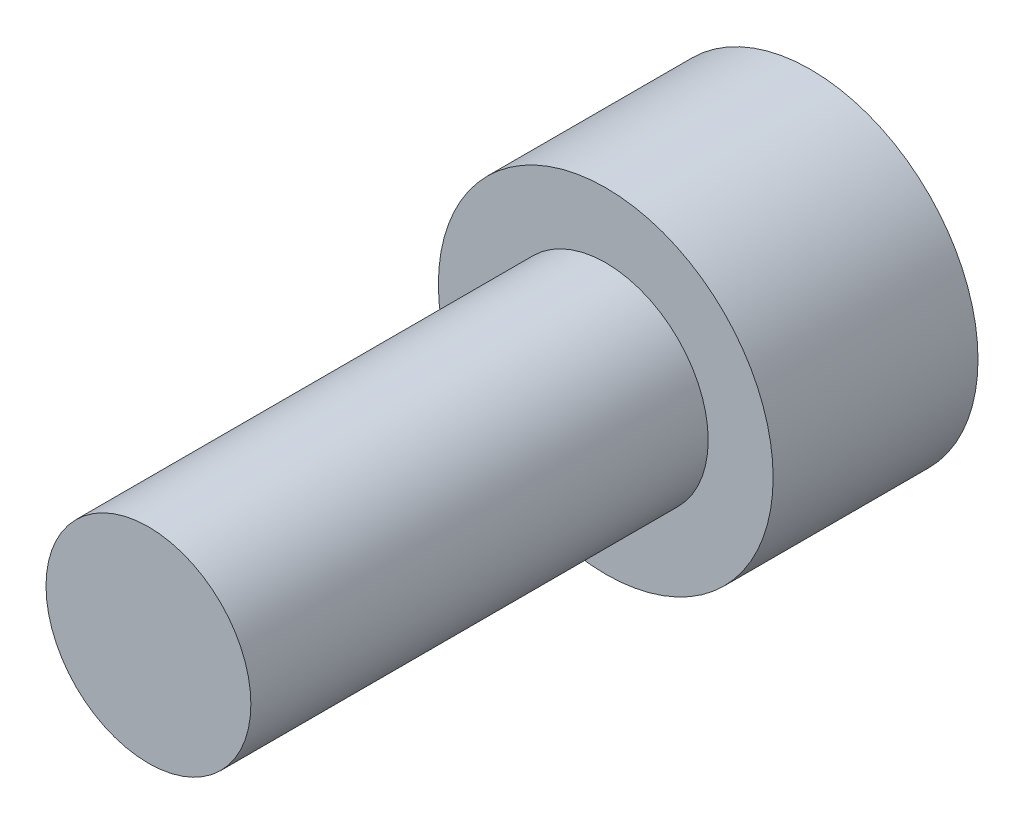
ISO-10303-21;
HEADER;
FILE_DESCRIPTION(('STEP AP214'),'2;1');
FILE_NAME('part.step','',(''),(''),'','','');
FILE_SCHEMA(('AUTOMOTIVE_DESIGN { 1 0 10303 214 1 1 1 1 }'));
ENDSEC;
DATA;
#1=APPLICATION_CONTEXT('core data for automotive mechanical design processes');
#2=APPLICATION_PROTOCOL_DEFINITION('international standard','automotive_design',2000,#1);
#3=PRODUCT_CONTEXT('',#1,'mechanical');
#4=PRODUCT('Part','Part','',(#3));
#5=PRODUCT_RELATED_PRODUCT_CATEGORY('part','',(#4));
#6=PRODUCT_DEFINITION_FORMATION('','',#4);
#7=PRODUCT_DEFINITION_CONTEXT('part definition',#1,'design');
#8=PRODUCT_DEFINITION('design','',#6,#7);
#9=PRODUCT_DEFINITION_SHAPE('','',#8);
#10=(LENGTH_UNIT() NAMED_UNIT(*) SI_UNIT(.MILLI.,.METRE.));
#11=(NAMED_UNIT(*) PLANE_ANGLE_UNIT() SI_UNIT($,.RADIAN.));
#12=(NAMED_UNIT(*) SI_UNIT($,.STERADIAN.) SOLID_ANGLE_UNIT());
#13=UNCERTAINTY_MEASURE_WITH_UNIT(LENGTH_MEASURE(1.E-05),#10,'distance_accuracy_value','');
#14=(GEOMETRIC_REPRESENTATION_CONTEXT(3) GLOBAL_UNCERTAINTY_ASSIGNED_CONTEXT((#13)) GLOBAL_UNIT_ASSIGNED_CONTEXT((#10,
#11,#12)) REPRESENTATION_CONTEXT('',''));
#15=CARTESIAN_POINT('',(0.,0.,0.));
#16=DIRECTION('',(0.,0.,1.));
#17=DIRECTION('',(1.,0.,0.));
#18=AXIS2_PLACEMENT_3D('',#15,#16,#17);
#19=CARTESIAN_POINT('',(0.,-2.3241,-2.8448));
#20=DIRECTION('',(0.,0.,-1.));
#21=DIRECTION('',(-1.,0.,0.));
#22=AXIS2_PLACEMENT_3D('',#19,#20,#21);
#23=PLANE('',#22);
#24=DIRECTION('',(0.866025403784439,-0.5,0.));
#25=VECTOR('',#24,1.);
#26=CARTESIAN_POINT('',(0.,1.36381680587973,-2.8448));
#27=LINE('',#26,#25);
#28=CARTESIAN_POINT('',(0.,1.36381680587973,-2.8448));
#29=VERTEX_POINT('',#28);
#30=CARTESIAN_POINT('',(1.1811,0.681908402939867,-2.8448));
#31=VERTEX_POINT('',#30);
#32=EDGE_CURVE('E51',#29,#31,#27,.T.);
#33=ORIENTED_EDGE('',*,*,#32,.F.);
#34=DIRECTION('',(0.866025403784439,0.5,0.));
#35=VECTOR('',#34,1.);
#36=CARTESIAN_POINT('',(-1.1811,0.681908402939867,-2.8448));
#37=LINE('',#36,#35);
#38=CARTESIAN_POINT('',(-1.1811,0.681908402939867,-2.8448));
#39=VERTEX_POINT('',#38);
#40=EDGE_CURVE('E134',#39,#29,#37,.T.);
#41=ORIENTED_EDGE('',*,*,#40,.F.);
#42=DIRECTION('',(0.,1.,0.));
#43=VECTOR('',#42,1.);
#44=CARTESIAN_POINT('',(-1.1811,-0.681908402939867,-2.8448));
#45=LINE('',#44,#43);
#46=CARTESIAN_POINT('',(-1.1811,-0.681908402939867,-2.8448));
#47=VERTEX_POINT('',#46);
#48=EDGE_CURVE('E132',#47,#39,#45,.T.);
#49=ORIENTED_EDGE('',*,*,#48,.F.);
#50=DIRECTION('',(-0.866025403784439,0.5,0.));
#51=VECTOR('',#50,1.);
#52=CARTESIAN_POINT('',(0.,-1.36381680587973,-2.8448));
#53=LINE('',#52,#51);
#54=CARTESIAN_POINT('',(0.,-1.36381680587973,-2.8448));
#55=VERTEX_POINT('',#54);
#56=EDGE_CURVE('E99',#55,#47,#53,.T.);
#57=ORIENTED_EDGE('',*,*,#56,.F.);
#58=DIRECTION('',(-0.866025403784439,-0.5,0.));
#59=VECTOR('',#58,1.);
#60=CARTESIAN_POINT('',(1.1811,-0.681908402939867,-2.8448));
#61=LINE('',#60,#59);
#62=CARTESIAN_POINT('',(1.1811,-0.681908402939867,-2.8448));
#63=VERTEX_POINT('',#62);
#64=EDGE_CURVE('E128',#63,#55,#61,.T.);
#65=ORIENTED_EDGE('',*,*,#64,.F.);
#66=DIRECTION('',(0.,-1.,0.));
#67=VECTOR('',#66,1.);
#68=CARTESIAN_POINT('',(1.1811,0.681908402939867,-2.8448));
#69=LINE('',#68,#67);
#70=EDGE_CURVE('E125',#31,#63,#69,.T.);
#71=ORIENTED_EDGE('',*,*,#70,.F.);
#72=EDGE_LOOP('',(#33,#41,#49,#57,#65,#71));
#73=FACE_BOUND('',#72,.T.);
#74=CARTESIAN_POINT('',(0.,0.,-2.8448));
#75=DIRECTION('',(0.,0.,1.));
#76=DIRECTION('',(1.,0.,0.));
#77=AXIS2_PLACEMENT_3D('',#74,#75,#76);
#78=CIRCLE('',#77,2.3241);
#79=CARTESIAN_POINT('',(2.3241,0.,-2.8448));
#80=VERTEX_POINT('',#79);
#81=EDGE_CURVE('E11',#80,#80,#78,.T.);
#82=ORIENTED_EDGE('',*,*,#81,.F.);
#83=EDGE_LOOP('',(#82));
#84=FACE_BOUND('',#83,.T.);
#85=ADVANCED_FACE('F37',(#73,#84),#23,.T.);
#86=CARTESIAN_POINT('',(0.,0.,6.35));
#87=DIRECTION('',(0.,0.,1.));
#88=DIRECTION('',(1.,0.,0.));
#89=AXIS2_PLACEMENT_3D('',#86,#87,#88);
#90=CYLINDRICAL_SURFACE('',#89,2.3241);
#91=ORIENTED_EDGE('',*,*,#81,.T.);
#92=EDGE_LOOP('',(#91));
#93=FACE_BOUND('',#92,.T.);
#94=CARTESIAN_POINT('',(0.,0.,0.));
#95=DIRECTION('',(0.,0.,1.));
#96=DIRECTION('',(1.,0.,0.));
#97=AXIS2_PLACEMENT_3D('',#94,#95,#96);
#98=CIRCLE('',#97,2.3241);
#99=CARTESIAN_POINT('',(2.3241,0.,0.));
#100=VERTEX_POINT('',#99);
#101=EDGE_CURVE('E44',#100,#100,#98,.T.);
#102=ORIENTED_EDGE('',*,*,#101,.F.);
#103=EDGE_LOOP('',(#102));
#104=FACE_BOUND('',#103,.T.);
#105=ADVANCED_FACE('F154',(#93,#104),#90,.T.);
#106=CARTESIAN_POINT('',(0.,-1.4224,0.));
#107=DIRECTION('',(0.,0.,1.));
#108=DIRECTION('',(1.,0.,0.));
#109=AXIS2_PLACEMENT_3D('',#106,#107,#108);
#110=PLANE('',#109);
#111=ORIENTED_EDGE('',*,*,#101,.T.);
#112=EDGE_LOOP('',(#111));
#113=FACE_BOUND('',#112,.T.);
#114=CARTESIAN_POINT('',(0.,0.,0.));
#115=DIRECTION('',(0.,0.,1.));
#116=DIRECTION('',(1.,0.,0.));
#117=AXIS2_PLACEMENT_3D('',#114,#115,#116);
#118=CIRCLE('',#117,1.4224);
#119=CARTESIAN_POINT('',(1.4224,0.,0.));
#120=VERTEX_POINT('',#119);
#121=EDGE_CURVE('E146',#120,#120,#118,.T.);
#122=ORIENTED_EDGE('',*,*,#121,.F.);
#123=EDGE_LOOP('',(#122));
#124=FACE_BOUND('',#123,.T.);
#125=ADVANCED_FACE('F151',(#113,#124),#110,.T.);
#126=CARTESIAN_POINT('',(0.,0.,6.35));
#127=DIRECTION('',(0.,0.,1.));
#128=DIRECTION('',(1.,0.,0.));
#129=AXIS2_PLACEMENT_3D('',#126,#127,#128);
#130=CYLINDRICAL_SURFACE('',#129,1.4224);
#131=ORIENTED_EDGE('',*,*,#121,.T.);
#132=EDGE_LOOP('',(#131));
#133=FACE_BOUND('',#132,.T.);
#134=CARTESIAN_POINT('',(0.,0.,6.35));
#135=DIRECTION('',(0.,0.,1.));
#136=DIRECTION('',(1.,0.,0.));
#137=AXIS2_PLACEMENT_3D('',#134,#135,#136);
#138=CIRCLE('',#137,1.4224);
#139=CARTESIAN_POINT('',(1.4224,0.,6.35));
#140=VERTEX_POINT('',#139);
#141=EDGE_CURVE('E138',#140,#140,#138,.T.);
#142=ORIENTED_EDGE('',*,*,#141,.F.);
#143=EDGE_LOOP('',(#142));
#144=FACE_BOUND('',#143,.T.);
#145=ADVANCED_FACE('F161',(#133,#144),#130,.T.);
#146=CARTESIAN_POINT('',(0.,0.,6.35));
#147=DIRECTION('',(0.,0.,1.));
#148=DIRECTION('',(1.,0.,0.));
#149=AXIS2_PLACEMENT_3D('',#146,#147,#148);
#150=PLANE('',#149);
#151=ORIENTED_EDGE('',*,*,#141,.T.);
#152=EDGE_LOOP('',(#151));
#153=FACE_BOUND('',#152,.T.);
#154=ADVANCED_FACE('F167',(#153),#150,.T.);
#155=CARTESIAN_POINT('',(0.,1.36381680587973,-1.0668));
#156=DIRECTION('',(0.5,0.866025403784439,0.));
#157=DIRECTION('',(-0.866025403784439,0.5,0.));
#158=AXIS2_PLACEMENT_3D('',#155,#156,#157);
#159=PLANE('',#158);
#160=ORIENTED_EDGE('',*,*,#32,.T.);
#161=DIRECTION('',(0.,0.,-1.));
#162=VECTOR('',#161,1.);
#163=CARTESIAN_POINT('',(1.1811,0.681908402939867,-1.0668));
#164=LINE('',#163,#162);
#165=CARTESIAN_POINT('',(1.1811,0.681908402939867,-1.0668));
#166=VERTEX_POINT('',#165);
#167=EDGE_CURVE('E81',#166,#31,#164,.T.);
#168=ORIENTED_EDGE('',*,*,#167,.F.);
#169=DIRECTION('',(0.866025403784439,-0.5,0.));
#170=VECTOR('',#169,1.);
#171=CARTESIAN_POINT('',(0.,1.36381680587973,-1.0668));
#172=LINE('',#171,#170);
#173=CARTESIAN_POINT('',(0.,1.36381680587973,-1.0668));
#174=VERTEX_POINT('',#173);
#175=EDGE_CURVE('E136',#174,#166,#172,.T.);
#176=ORIENTED_EDGE('',*,*,#175,.F.);
#177=DIRECTION('',(0.,0.,-1.));
#178=VECTOR('',#177,1.);
#179=CARTESIAN_POINT('',(0.,1.36381680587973,-1.0668));
#180=LINE('',#179,#178);
#181=EDGE_CURVE('E59',#174,#29,#180,.T.);
#182=ORIENTED_EDGE('',*,*,#181,.T.);
#183=EDGE_LOOP('',(#160,#168,#176,#182));
#184=FACE_BOUND('',#183,.T.);
#185=ADVANCED_FACE('F171',(#184),#159,.F.);
#186=CARTESIAN_POINT('',(-1.1811,0.681908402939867,-1.0668));
#187=DIRECTION('',(-0.5,0.866025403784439,0.));
#188=DIRECTION('',(-0.866025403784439,-0.5,0.));
#189=AXIS2_PLACEMENT_3D('',#186,#187,#188);
#190=PLANE('',#189);
#191=ORIENTED_EDGE('',*,*,#40,.T.);
#192=ORIENTED_EDGE('',*,*,#181,.F.);
#193=DIRECTION('',(0.866025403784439,0.5,0.));
#194=VECTOR('',#193,1.);
#195=CARTESIAN_POINT('',(-1.1811,0.681908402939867,-1.0668));
#196=LINE('',#195,#194);
#197=CARTESIAN_POINT('',(-1.1811,0.681908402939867,-1.0668));
#198=VERTEX_POINT('',#197);
#199=EDGE_CURVE('E111',#198,#174,#196,.T.);
#200=ORIENTED_EDGE('',*,*,#199,.F.);
#201=DIRECTION('',(0.,0.,-1.));
#202=VECTOR('',#201,1.);
#203=CARTESIAN_POINT('',(-1.1811,0.681908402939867,-1.0668));
#204=LINE('',#203,#202);
#205=EDGE_CURVE('E103',#198,#39,#204,.T.);
#206=ORIENTED_EDGE('',*,*,#205,.T.);
#207=EDGE_LOOP('',(#191,#192,#200,#206));
#208=FACE_BOUND('',#207,.T.);
#209=ADVANCED_FACE('F175',(#208),#190,.F.);
#210=CARTESIAN_POINT('',(-1.1811,-0.681908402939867,-1.0668));
#211=DIRECTION('',(-1.,0.,0.));
#212=DIRECTION('',(0.,-1.,0.));
#213=AXIS2_PLACEMENT_3D('',#210,#211,#212);
#214=PLANE('',#213);
#215=ORIENTED_EDGE('',*,*,#48,.T.);
#216=ORIENTED_EDGE('',*,*,#205,.F.);
#217=DIRECTION('',(0.,1.,0.));
#218=VECTOR('',#217,1.);
#219=CARTESIAN_POINT('',(-1.1811,-0.681908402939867,-1.0668));
#220=LINE('',#219,#218);
#221=CARTESIAN_POINT('',(-1.1811,-0.681908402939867,-1.0668));
#222=VERTEX_POINT('',#221);
#223=EDGE_CURVE('E107',#222,#198,#220,.T.);
#224=ORIENTED_EDGE('',*,*,#223,.F.);
#225=DIRECTION('',(0.,0.,-1.));
#226=VECTOR('',#225,1.);
#227=CARTESIAN_POINT('',(-1.1811,-0.681908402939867,-1.0668));
#228=LINE('',#227,#226);
#229=EDGE_CURVE('E92',#222,#47,#228,.T.);
#230=ORIENTED_EDGE('',*,*,#229,.T.);
#231=EDGE_LOOP('',(#215,#216,#224,#230));
#232=FACE_BOUND('',#231,.T.);
#233=ADVANCED_FACE('F108',(#232),#214,.F.);
#234=CARTESIAN_POINT('',(0.,-1.36381680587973,-1.0668));
#235=DIRECTION('',(-0.5,-0.866025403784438,0.));
#236=DIRECTION('',(0.866025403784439,-0.5,0.));
#237=AXIS2_PLACEMENT_3D('',#234,#235,#236);
#238=PLANE('',#237);
#239=ORIENTED_EDGE('',*,*,#56,.T.);
#240=ORIENTED_EDGE('',*,*,#229,.F.);
#241=DIRECTION('',(-0.866025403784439,0.5,0.));
#242=VECTOR('',#241,1.);
#243=CARTESIAN_POINT('',(0.,-1.36381680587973,-1.0668));
#244=LINE('',#243,#242);
#245=CARTESIAN_POINT('',(0.,-1.36381680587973,-1.0668));
#246=VERTEX_POINT('',#245);
#247=EDGE_CURVE('E96',#246,#222,#244,.T.);
#248=ORIENTED_EDGE('',*,*,#247,.F.);
#249=DIRECTION('',(0.,0.,-1.));
#250=VECTOR('',#249,1.);
#251=CARTESIAN_POINT('',(0.,-1.36381680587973,-1.0668));
#252=LINE('',#251,#250);
#253=EDGE_CURVE('E104',#246,#55,#252,.T.);
#254=ORIENTED_EDGE('',*,*,#253,.T.);
#255=EDGE_LOOP('',(#239,#240,#248,#254));
#256=FACE_BOUND('',#255,.T.);
#257=ADVANCED_FACE('F94',(#256),#238,.F.);
#258=CARTESIAN_POINT('',(1.1811,-0.681908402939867,-1.0668));
#259=DIRECTION('',(0.5,-0.866025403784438,0.));
#260=DIRECTION('',(0.866025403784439,0.5,0.));
#261=AXIS2_PLACEMENT_3D('',#258,#259,#260);
#262=PLANE('',#261);
#263=ORIENTED_EDGE('',*,*,#64,.T.);
#264=ORIENTED_EDGE('',*,*,#253,.F.);
#265=DIRECTION('',(-0.866025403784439,-0.5,0.));
#266=VECTOR('',#265,1.);
#267=CARTESIAN_POINT('',(1.1811,-0.681908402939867,-1.0668));
#268=LINE('',#267,#266);
#269=CARTESIAN_POINT('',(1.1811,-0.681908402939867,-1.0668));
#270=VERTEX_POINT('',#269);
#271=EDGE_CURVE('E117',#270,#246,#268,.T.);
#272=ORIENTED_EDGE('',*,*,#271,.F.);
#273=DIRECTION('',(0.,0.,-1.));
#274=VECTOR('',#273,1.);
#275=CARTESIAN_POINT('',(1.1811,-0.681908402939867,-1.0668));
#276=LINE('',#275,#274);
#277=EDGE_CURVE('E141',#270,#63,#276,.T.);
#278=ORIENTED_EDGE('',*,*,#277,.T.);
#279=EDGE_LOOP('',(#263,#264,#272,#278));
#280=FACE_BOUND('',#279,.T.);
#281=ADVANCED_FACE('F179',(#280),#262,.F.);
#282=CARTESIAN_POINT('',(1.1811,0.681908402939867,-1.0668));
#283=DIRECTION('',(1.,0.,0.));
#284=DIRECTION('',(0.,0.,-1.));
#285=AXIS2_PLACEMENT_3D('',#282,#283,#284);
#286=PLANE('',#285);
#287=ORIENTED_EDGE('',*,*,#70,.T.);
#288=ORIENTED_EDGE('',*,*,#277,.F.);
#289=DIRECTION('',(0.,-1.,0.));
#290=VECTOR('',#289,1.);
#291=CARTESIAN_POINT('',(1.1811,0.681908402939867,-1.0668));
#292=LINE('',#291,#290);
#293=EDGE_CURVE('E119',#166,#270,#292,.T.);
#294=ORIENTED_EDGE('',*,*,#293,.F.);
#295=ORIENTED_EDGE('',*,*,#167,.T.);
#296=EDGE_LOOP('',(#287,#288,#294,#295));
#297=FACE_BOUND('',#296,.T.);
#298=ADVANCED_FACE('F176',(#297),#286,.F.);
#299=CARTESIAN_POINT('',(1.1811,0.681908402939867,-1.0668));
#300=DIRECTION('',(0.,0.,-1.));
#301=DIRECTION('',(-1.,0.,0.));
#302=AXIS2_PLACEMENT_3D('',#299,#300,#301);
#303=PLANE('',#302);
#304=ORIENTED_EDGE('',*,*,#175,.T.);
#305=ORIENTED_EDGE('',*,*,#293,.T.);
#306=ORIENTED_EDGE('',*,*,#271,.T.);
#307=ORIENTED_EDGE('',*,*,#247,.T.);
#308=ORIENTED_EDGE('',*,*,#223,.T.);
#309=ORIENTED_EDGE('',*,*,#199,.T.);
#310=EDGE_LOOP('',(#304,#305,#306,#307,#308,#309));
#311=FACE_BOUND('',#310,.T.);
#312=ADVANCED_FACE('F114',(#311),#303,.T.);
#313=CLOSED_SHELL('',(#85,#105,#125,#145,#154,#185,#209,#233,#257,#281,#298,#312));
#314=MANIFOLD_SOLID_BREP('B2',#313);
#315=ADVANCED_BREP_SHAPE_REPRESENTATION('',(#18,#314),#14);
#316=SHAPE_DEFINITION_REPRESENTATION(#9,#315);
ENDSEC;
END-ISO-10303-21;
